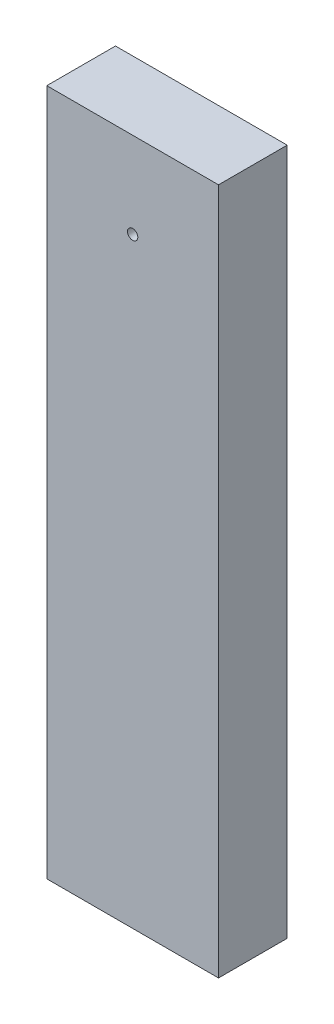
ISO-10303-21;
HEADER;
FILE_DESCRIPTION(('STEP AP214'),'2;1');
FILE_NAME('part.step','',(''),(''),'','','');
FILE_SCHEMA(('AUTOMOTIVE_DESIGN { 1 0 10303 214 1 1 1 1 }'));
ENDSEC;
DATA;
#1=APPLICATION_CONTEXT('core data for automotive mechanical design processes');
#2=APPLICATION_PROTOCOL_DEFINITION('international standard','automotive_design',2000,#1);
#3=PRODUCT_CONTEXT('',#1,'mechanical');
#4=PRODUCT('Part','Part','',(#3));
#5=PRODUCT_RELATED_PRODUCT_CATEGORY('part','',(#4));
#6=PRODUCT_DEFINITION_FORMATION('','',#4);
#7=PRODUCT_DEFINITION_CONTEXT('part definition',#1,'design');
#8=PRODUCT_DEFINITION('design','',#6,#7);
#9=PRODUCT_DEFINITION_SHAPE('','',#8);
#10=(LENGTH_UNIT() NAMED_UNIT(*) SI_UNIT(.MILLI.,.METRE.));
#11=(NAMED_UNIT(*) PLANE_ANGLE_UNIT() SI_UNIT($,.RADIAN.));
#12=(NAMED_UNIT(*) SI_UNIT($,.STERADIAN.) SOLID_ANGLE_UNIT());
#13=UNCERTAINTY_MEASURE_WITH_UNIT(LENGTH_MEASURE(1.E-05),#10,'distance_accuracy_value','');
#14=(GEOMETRIC_REPRESENTATION_CONTEXT(3) GLOBAL_UNCERTAINTY_ASSIGNED_CONTEXT((#13)) GLOBAL_UNIT_ASSIGNED_CONTEXT((#10,
#11,#12)) REPRESENTATION_CONTEXT('',''));
#15=CARTESIAN_POINT('',(0.,0.,0.));
#16=DIRECTION('',(0.,0.,1.));
#17=DIRECTION('',(1.,0.,0.));
#18=AXIS2_PLACEMENT_3D('',#15,#16,#17);
#19=CARTESIAN_POINT('',(0.,0.,10.));
#20=DIRECTION('',(1.,0.,0.));
#21=DIRECTION('',(0.,0.,-1.));
#22=AXIS2_PLACEMENT_3D('',#19,#20,#21);
#23=PLANE('',#22);
#24=DIRECTION('',(0.,-1.,0.));
#25=VECTOR('',#24,1.);
#26=CARTESIAN_POINT('',(0.,0.,0.));
#27=LINE('',#26,#25);
#28=CARTESIAN_POINT('',(0.,100.,0.));
#29=VERTEX_POINT('',#28);
#30=CARTESIAN_POINT('',(0.,0.,0.));
#31=VERTEX_POINT('',#30);
#32=EDGE_CURVE('E95',#29,#31,#27,.T.);
#33=ORIENTED_EDGE('',*,*,#32,.T.);
#34=DIRECTION('',(0.,0.,-1.));
#35=VECTOR('',#34,1.);
#36=CARTESIAN_POINT('',(0.,0.,10.));
#37=LINE('',#36,#35);
#38=CARTESIAN_POINT('',(0.,0.,10.));
#39=VERTEX_POINT('',#38);
#40=EDGE_CURVE('E11',#39,#31,#37,.T.);
#41=ORIENTED_EDGE('',*,*,#40,.F.);
#42=DIRECTION('',(0.,-1.,0.));
#43=VECTOR('',#42,1.);
#44=CARTESIAN_POINT('',(0.,0.,10.));
#45=LINE('',#44,#43);
#46=CARTESIAN_POINT('',(0.,100.,10.));
#47=VERTEX_POINT('',#46);
#48=EDGE_CURVE('E83',#47,#39,#45,.T.);
#49=ORIENTED_EDGE('',*,*,#48,.F.);
#50=DIRECTION('',(0.,0.,-1.));
#51=VECTOR('',#50,1.);
#52=CARTESIAN_POINT('',(0.,100.,10.));
#53=LINE('',#52,#51);
#54=EDGE_CURVE('E91',#47,#29,#53,.T.);
#55=ORIENTED_EDGE('',*,*,#54,.T.);
#56=EDGE_LOOP('',(#33,#41,#49,#55));
#57=FACE_BOUND('',#56,.T.);
#58=ADVANCED_FACE('F32',(#57),#23,.F.);
#59=CARTESIAN_POINT('',(0.,0.,10.));
#60=DIRECTION('',(0.,1.,0.));
#61=DIRECTION('',(0.,0.,1.));
#62=AXIS2_PLACEMENT_3D('',#59,#60,#61);
#63=PLANE('',#62);
#64=CARTESIAN_POINT('',(12.5,0.,5.));
#65=DIRECTION('',(0.,-1.,0.));
#66=DIRECTION('',(0.,0.,-1.));
#67=AXIS2_PLACEMENT_3D('',#64,#65,#66);
#68=CIRCLE('',#67,0.75);
#69=CARTESIAN_POINT('',(12.5,0.,4.25));
#70=VERTEX_POINT('',#69);
#71=EDGE_CURVE('E109',#70,#70,#68,.T.);
#72=ORIENTED_EDGE('',*,*,#71,.F.);
#73=EDGE_LOOP('',(#72));
#74=FACE_BOUND('',#73,.T.);
#75=DIRECTION('',(1.,0.,0.));
#76=VECTOR('',#75,1.);
#77=CARTESIAN_POINT('',(0.,0.,0.));
#78=LINE('',#77,#76);
#79=CARTESIAN_POINT('',(25.,0.,0.));
#80=VERTEX_POINT('',#79);
#81=EDGE_CURVE('E87',#31,#80,#78,.T.);
#82=ORIENTED_EDGE('',*,*,#81,.T.);
#83=DIRECTION('',(0.,0.,-1.));
#84=VECTOR('',#83,1.);
#85=CARTESIAN_POINT('',(25.,0.,10.));
#86=LINE('',#85,#84);
#87=CARTESIAN_POINT('',(25.,0.,10.));
#88=VERTEX_POINT('',#87);
#89=EDGE_CURVE('E40',#88,#80,#86,.T.);
#90=ORIENTED_EDGE('',*,*,#89,.F.);
#91=DIRECTION('',(1.,0.,0.));
#92=VECTOR('',#91,1.);
#93=CARTESIAN_POINT('',(0.,0.,10.));
#94=LINE('',#93,#92);
#95=EDGE_CURVE('E78',#39,#88,#94,.T.);
#96=ORIENTED_EDGE('',*,*,#95,.F.);
#97=ORIENTED_EDGE('',*,*,#40,.T.);
#98=EDGE_LOOP('',(#82,#90,#96,#97));
#99=FACE_BOUND('',#98,.T.);
#100=ADVANCED_FACE('F86',(#74,#99),#63,.F.);
#101=CARTESIAN_POINT('',(25.,0.,10.));
#102=DIRECTION('',(-1.,0.,0.));
#103=DIRECTION('',(0.,0.,1.));
#104=AXIS2_PLACEMENT_3D('',#101,#102,#103);
#105=PLANE('',#104);
#106=DIRECTION('',(0.,1.,0.));
#107=VECTOR('',#106,1.);
#108=CARTESIAN_POINT('',(25.,0.,0.));
#109=LINE('',#108,#107);
#110=CARTESIAN_POINT('',(25.,100.,0.));
#111=VERTEX_POINT('',#110);
#112=EDGE_CURVE('E65',#80,#111,#109,.T.);
#113=ORIENTED_EDGE('',*,*,#112,.T.);
#114=DIRECTION('',(0.,0.,-1.));
#115=VECTOR('',#114,1.);
#116=CARTESIAN_POINT('',(25.,100.,10.));
#117=LINE('',#116,#115);
#118=CARTESIAN_POINT('',(25.,100.,10.));
#119=VERTEX_POINT('',#118);
#120=EDGE_CURVE('E88',#119,#111,#117,.T.);
#121=ORIENTED_EDGE('',*,*,#120,.F.);
#122=DIRECTION('',(0.,1.,0.));
#123=VECTOR('',#122,1.);
#124=CARTESIAN_POINT('',(25.,0.,10.));
#125=LINE('',#124,#123);
#126=EDGE_CURVE('E81',#88,#119,#125,.T.);
#127=ORIENTED_EDGE('',*,*,#126,.F.);
#128=ORIENTED_EDGE('',*,*,#89,.T.);
#129=EDGE_LOOP('',(#113,#121,#127,#128));
#130=FACE_BOUND('',#129,.T.);
#131=ADVANCED_FACE('F89',(#130),#105,.F.);
#132=CARTESIAN_POINT('',(0.,100.,10.));
#133=DIRECTION('',(0.,-1.,0.));
#134=DIRECTION('',(0.,0.,-1.));
#135=AXIS2_PLACEMENT_3D('',#132,#133,#134);
#136=PLANE('',#135);
#137=DIRECTION('',(-1.,0.,0.));
#138=VECTOR('',#137,1.);
#139=CARTESIAN_POINT('',(0.,100.,0.));
#140=LINE('',#139,#138);
#141=EDGE_CURVE('E71',#111,#29,#140,.T.);
#142=ORIENTED_EDGE('',*,*,#141,.T.);
#143=ORIENTED_EDGE('',*,*,#54,.F.);
#144=DIRECTION('',(-1.,0.,0.));
#145=VECTOR('',#144,1.);
#146=CARTESIAN_POINT('',(0.,100.,10.));
#147=LINE('',#146,#145);
#148=EDGE_CURVE('E48',#119,#47,#147,.T.);
#149=ORIENTED_EDGE('',*,*,#148,.F.);
#150=ORIENTED_EDGE('',*,*,#120,.T.);
#151=EDGE_LOOP('',(#142,#143,#149,#150));
#152=FACE_BOUND('',#151,.T.);
#153=ADVANCED_FACE('F103',(#152),#136,.F.);
#154=CARTESIAN_POINT('',(0.,0.,10.));
#155=DIRECTION('',(0.,0.,-1.));
#156=DIRECTION('',(-1.,0.,0.));
#157=AXIS2_PLACEMENT_3D('',#154,#155,#156);
#158=PLANE('',#157);
#159=CARTESIAN_POINT('',(12.5,87.5,10.));
#160=DIRECTION('',(0.,0.,1.));
#161=DIRECTION('',(1.,0.,0.));
#162=AXIS2_PLACEMENT_3D('',#159,#160,#161);
#163=CIRCLE('',#162,0.75);
#164=CARTESIAN_POINT('',(13.25,87.5,10.));
#165=VERTEX_POINT('',#164);
#166=EDGE_CURVE('E115',#165,#165,#163,.T.);
#167=ORIENTED_EDGE('',*,*,#166,.F.);
#168=EDGE_LOOP('',(#167));
#169=FACE_BOUND('',#168,.T.);
#170=ORIENTED_EDGE('',*,*,#48,.T.);
#171=ORIENTED_EDGE('',*,*,#95,.T.);
#172=ORIENTED_EDGE('',*,*,#126,.T.);
#173=ORIENTED_EDGE('',*,*,#148,.T.);
#174=EDGE_LOOP('',(#170,#171,#172,#173));
#175=FACE_BOUND('',#174,.T.);
#176=ADVANCED_FACE('F79',(#169,#175),#158,.F.);
#177=CARTESIAN_POINT('',(0.,0.,0.));
#178=DIRECTION('',(0.,0.,-1.));
#179=DIRECTION('',(-1.,0.,0.));
#180=AXIS2_PLACEMENT_3D('',#177,#178,#179);
#181=PLANE('',#180);
#182=ORIENTED_EDGE('',*,*,#32,.F.);
#183=ORIENTED_EDGE('',*,*,#141,.F.);
#184=ORIENTED_EDGE('',*,*,#112,.F.);
#185=ORIENTED_EDGE('',*,*,#81,.F.);
#186=EDGE_LOOP('',(#182,#183,#184,#185));
#187=FACE_BOUND('',#186,.T.);
#188=ADVANCED_FACE('F106',(#187),#181,.T.);
#189=CARTESIAN_POINT('',(12.5,10.,5.));
#190=DIRECTION('',(0.,-1.,0.));
#191=DIRECTION('',(0.,0.,-1.));
#192=AXIS2_PLACEMENT_3D('',#189,#190,#191);
#193=CYLINDRICAL_SURFACE('',#192,0.75);
#194=CARTESIAN_POINT('',(12.5,10.,5.));
#195=DIRECTION('',(0.,-1.,0.));
#196=DIRECTION('',(0.,0.,-1.));
#197=AXIS2_PLACEMENT_3D('',#194,#195,#196);
#198=CIRCLE('',#197,0.75);
#199=CARTESIAN_POINT('',(12.5,10.,4.25));
#200=VERTEX_POINT('',#199);
#201=EDGE_CURVE('E98',#200,#200,#198,.T.);
#202=ORIENTED_EDGE('',*,*,#201,.F.);
#203=EDGE_LOOP('',(#202));
#204=FACE_BOUND('',#203,.T.);
#205=ORIENTED_EDGE('',*,*,#71,.T.);
#206=EDGE_LOOP('',(#205));
#207=FACE_BOUND('',#206,.T.);
#208=ADVANCED_FACE('F137',(#204,#207),#193,.F.);
#209=CARTESIAN_POINT('',(12.5,10.,5.));
#210=DIRECTION('',(0.,-1.,0.));
#211=DIRECTION('',(0.,0.,-1.));
#212=AXIS2_PLACEMENT_3D('',#209,#210,#211);
#213=PLANE('',#212);
#214=ORIENTED_EDGE('',*,*,#201,.T.);
#215=EDGE_LOOP('',(#214));
#216=FACE_BOUND('',#215,.T.);
#217=ADVANCED_FACE('F126',(#216),#213,.T.);
#218=CARTESIAN_POINT('',(12.5,87.5,5.));
#219=DIRECTION('',(0.,0.,1.));
#220=DIRECTION('',(1.,0.,0.));
#221=AXIS2_PLACEMENT_3D('',#218,#219,#220);
#222=CYLINDRICAL_SURFACE('',#221,0.75);
#223=CARTESIAN_POINT('',(12.5,87.5,5.));
#224=DIRECTION('',(0.,0.,1.));
#225=DIRECTION('',(1.,0.,0.));
#226=AXIS2_PLACEMENT_3D('',#223,#224,#225);
#227=CIRCLE('',#226,0.75);
#228=CARTESIAN_POINT('',(13.25,87.5,5.));
#229=VERTEX_POINT('',#228);
#230=EDGE_CURVE('E112',#229,#229,#227,.T.);
#231=ORIENTED_EDGE('',*,*,#230,.F.);
#232=EDGE_LOOP('',(#231));
#233=FACE_BOUND('',#232,.T.);
#234=ORIENTED_EDGE('',*,*,#166,.T.);
#235=EDGE_LOOP('',(#234));
#236=FACE_BOUND('',#235,.T.);
#237=ADVANCED_FACE('F123',(#233,#236),#222,.F.);
#238=CARTESIAN_POINT('',(12.5,87.5,5.));
#239=DIRECTION('',(0.,0.,1.));
#240=DIRECTION('',(1.,0.,0.));
#241=AXIS2_PLACEMENT_3D('',#238,#239,#240);
#242=PLANE('',#241);
#243=ORIENTED_EDGE('',*,*,#230,.T.);
#244=EDGE_LOOP('',(#243));
#245=FACE_BOUND('',#244,.T.);
#246=ADVANCED_FACE('F121',(#245),#242,.T.);
#247=CLOSED_SHELL('',(#58,#100,#131,#153,#176,#188,#208,#217,#237,#246));
#248=MANIFOLD_SOLID_BREP('B2',#247);
#249=ADVANCED_BREP_SHAPE_REPRESENTATION('',(#18,#248),#14);
#250=SHAPE_DEFINITION_REPRESENTATION(#9,#249);
ENDSEC;
END-ISO-10303-21;
